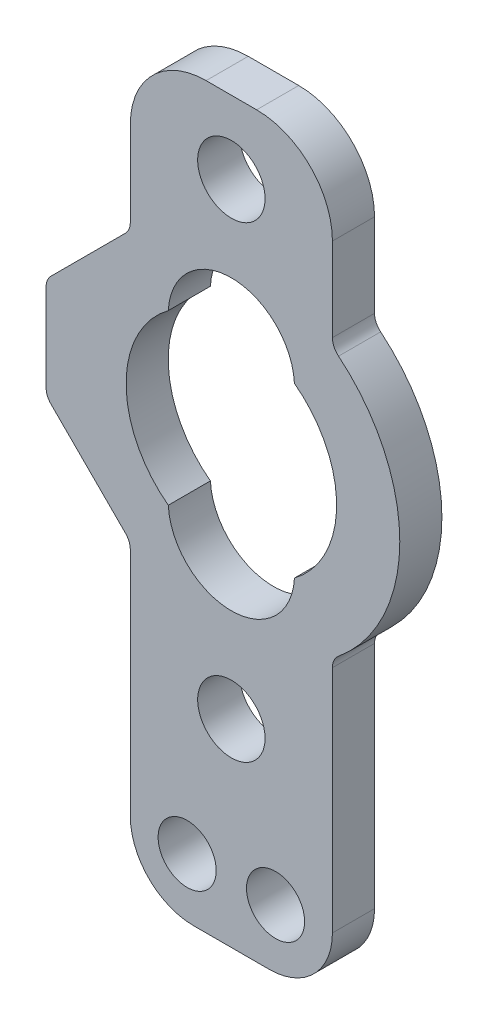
ISO-10303-21;
HEADER;
FILE_DESCRIPTION(('STEP AP214'),'2;1');
FILE_NAME('part.step','',(''),(''),'','','');
FILE_SCHEMA(('AUTOMOTIVE_DESIGN { 1 0 10303 214 1 1 1 1 }'));
ENDSEC;
DATA;
#1=APPLICATION_CONTEXT('core data for automotive mechanical design processes');
#2=APPLICATION_PROTOCOL_DEFINITION('international standard','automotive_design',2000,#1);
#3=PRODUCT_CONTEXT('',#1,'mechanical');
#4=PRODUCT('Part','Part','',(#3));
#5=PRODUCT_RELATED_PRODUCT_CATEGORY('part','',(#4));
#6=PRODUCT_DEFINITION_FORMATION('','',#4);
#7=PRODUCT_DEFINITION_CONTEXT('part definition',#1,'design');
#8=PRODUCT_DEFINITION('design','',#6,#7);
#9=PRODUCT_DEFINITION_SHAPE('','',#8);
#10=(LENGTH_UNIT() NAMED_UNIT(*) SI_UNIT(.MILLI.,.METRE.));
#11=(NAMED_UNIT(*) PLANE_ANGLE_UNIT() SI_UNIT($,.RADIAN.));
#12=(NAMED_UNIT(*) SI_UNIT($,.STERADIAN.) SOLID_ANGLE_UNIT());
#13=UNCERTAINTY_MEASURE_WITH_UNIT(LENGTH_MEASURE(1.E-05),#10,'distance_accuracy_value','');
#14=(GEOMETRIC_REPRESENTATION_CONTEXT(3) GLOBAL_UNCERTAINTY_ASSIGNED_CONTEXT((#13)) GLOBAL_UNIT_ASSIGNED_CONTEXT((#10,
#11,#12)) REPRESENTATION_CONTEXT('',''));
#15=CARTESIAN_POINT('',(0.,0.,0.));
#16=DIRECTION('',(0.,0.,1.));
#17=DIRECTION('',(1.,0.,0.));
#18=AXIS2_PLACEMENT_3D('',#15,#16,#17);
#19=CARTESIAN_POINT('',(4.50000000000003,7.5,5.));
#20=DIRECTION('',(0.,0.,-1.));
#21=DIRECTION('',(-1.,0.,0.));
#22=AXIS2_PLACEMENT_3D('',#19,#20,#21);
#23=PLANE('',#22);
#24=CARTESIAN_POINT('',(0.,61.375,5.));
#25=DIRECTION('',(0.,0.,1.));
#26=DIRECTION('',(-1.,0.,0.));
#27=AXIS2_PLACEMENT_3D('',#24,#25,#26);
#28=CIRCLE('',#27,7.5);
#29=CARTESIAN_POINT('',(7.49024984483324,61.7573051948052,5.));
#30=VERTEX_POINT('',#29);
#31=CARTESIAN_POINT('',(-7.49024984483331,61.7573051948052,5.));
#32=VERTEX_POINT('',#31);
#33=EDGE_CURVE('E205',#30,#32,#28,.T.);
#34=ORIENTED_EDGE('',*,*,#33,.F.);
#35=CARTESIAN_POINT('',(0.,51.75,5.));
#36=DIRECTION('',(0.,0.,1.));
#37=DIRECTION('',(1.,0.,0.));
#38=AXIS2_PLACEMENT_3D('',#35,#36,#37);
#39=CIRCLE('',#38,12.5);
#40=CARTESIAN_POINT('',(7.49024984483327,41.7426948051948,5.));
#41=VERTEX_POINT('',#40);
#42=EDGE_CURVE('E226',#41,#30,#39,.T.);
#43=ORIENTED_EDGE('',*,*,#42,.F.);
#44=CARTESIAN_POINT('',(0.,42.125,5.));
#45=DIRECTION('',(0.,0.,1.));
#46=DIRECTION('',(1.,0.,0.));
#47=AXIS2_PLACEMENT_3D('',#44,#45,#46);
#48=CIRCLE('',#47,7.5);
#49=CARTESIAN_POINT('',(-7.49024984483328,41.7426948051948,5.));
#50=VERTEX_POINT('',#49);
#51=EDGE_CURVE('E224',#50,#41,#48,.T.);
#52=ORIENTED_EDGE('',*,*,#51,.F.);
#53=CARTESIAN_POINT('',(0.,51.75,5.));
#54=DIRECTION('',(0.,0.,1.));
#55=DIRECTION('',(1.,0.,0.));
#56=AXIS2_PLACEMENT_3D('',#53,#54,#55);
#57=CIRCLE('',#56,12.5);
#58=EDGE_CURVE('E222',#32,#50,#57,.T.);
#59=ORIENTED_EDGE('',*,*,#58,.F.);
#60=EDGE_LOOP('',(#34,#43,#52,#59));
#61=FACE_BOUND('',#60,.T.);
#62=CARTESIAN_POINT('',(5.24999999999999,7.,5.));
#63=DIRECTION('',(0.,0.,1.));
#64=DIRECTION('',(-1.,0.,0.));
#65=AXIS2_PLACEMENT_3D('',#62,#63,#64);
#66=CIRCLE('',#65,3.45);
#67=CARTESIAN_POINT('',(1.79999999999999,7.,5.));
#68=VERTEX_POINT('',#67);
#69=EDGE_CURVE('E240',#68,#68,#66,.T.);
#70=ORIENTED_EDGE('',*,*,#69,.F.);
#71=EDGE_LOOP('',(#70));
#72=FACE_BOUND('',#71,.T.);
#73=CARTESIAN_POINT('',(4.50000000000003,7.5,5.));
#74=DIRECTION('',(0.,0.,1.));
#75=DIRECTION('',(-1.,0.,0.));
#76=AXIS2_PLACEMENT_3D('',#73,#74,#75);
#77=CIRCLE('',#76,7.5);
#78=CARTESIAN_POINT('',(4.49999999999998,0.,5.));
#79=VERTEX_POINT('',#78);
#80=CARTESIAN_POINT('',(12.,7.50000000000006,5.));
#81=VERTEX_POINT('',#80);
#82=EDGE_CURVE('E290',#79,#81,#77,.T.);
#83=ORIENTED_EDGE('',*,*,#82,.T.);
#84=DIRECTION('',(0.,1.,0.));
#85=VECTOR('',#84,1.);
#86=CARTESIAN_POINT('',(12.,7.50000000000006,5.));
#87=LINE('',#86,#85);
#88=CARTESIAN_POINT('',(12.,34.7794372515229,5.));
#89=VERTEX_POINT('',#88);
#90=EDGE_CURVE('E293',#81,#89,#87,.T.);
#91=ORIENTED_EDGE('',*,*,#90,.T.);
#92=CARTESIAN_POINT('',(14.,34.7794372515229,5.));
#93=DIRECTION('',(0.,0.,-1.));
#94=DIRECTION('',(1.,0.,0.));
#95=AXIS2_PLACEMENT_3D('',#92,#93,#94);
#96=CIRCLE('',#95,2.);
#97=CARTESIAN_POINT('',(12.7272727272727,36.3222156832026,5.));
#98=VERTEX_POINT('',#97);
#99=EDGE_CURVE('E295',#89,#98,#96,.T.);
#100=ORIENTED_EDGE('',*,*,#99,.T.);
#101=CARTESIAN_POINT('',(0.,51.75,5.));
#102=DIRECTION('',(0.,0.,1.));
#103=DIRECTION('',(-1.,0.,0.));
#104=AXIS2_PLACEMENT_3D('',#101,#102,#103);
#105=CIRCLE('',#104,20.);
#106=CARTESIAN_POINT('',(12.7272727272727,67.1777843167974,5.));
#107=VERTEX_POINT('',#106);
#108=EDGE_CURVE('E297',#98,#107,#105,.T.);
#109=ORIENTED_EDGE('',*,*,#108,.T.);
#110=CARTESIAN_POINT('',(14.,68.7205627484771,5.));
#111=DIRECTION('',(0.,0.,-1.));
#112=DIRECTION('',(-1.,0.,0.));
#113=AXIS2_PLACEMENT_3D('',#110,#111,#112);
#114=CIRCLE('',#113,2.);
#115=CARTESIAN_POINT('',(12.,68.7205627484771,5.));
#116=VERTEX_POINT('',#115);
#117=EDGE_CURVE('E299',#107,#116,#114,.T.);
#118=ORIENTED_EDGE('',*,*,#117,.T.);
#119=DIRECTION('',(0.,1.,0.));
#120=VECTOR('',#119,1.);
#121=CARTESIAN_POINT('',(12.,68.7205627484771,5.));
#122=LINE('',#121,#120);
#123=CARTESIAN_POINT('',(12.,78.6499999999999,5.));
#124=VERTEX_POINT('',#123);
#125=EDGE_CURVE('E301',#116,#124,#122,.T.);
#126=ORIENTED_EDGE('',*,*,#125,.T.);
#127=CARTESIAN_POINT('',(3.00000000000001,78.65,5.));
#128=DIRECTION('',(0.,0.,1.));
#129=DIRECTION('',(-1.,0.,0.));
#130=AXIS2_PLACEMENT_3D('',#127,#128,#129);
#131=CIRCLE('',#130,9.);
#132=CARTESIAN_POINT('',(2.99999999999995,87.65,5.));
#133=VERTEX_POINT('',#132);
#134=EDGE_CURVE('E303',#124,#133,#131,.T.);
#135=ORIENTED_EDGE('',*,*,#134,.T.);
#136=DIRECTION('',(-1.,0.,0.));
#137=VECTOR('',#136,1.);
#138=CARTESIAN_POINT('',(2.99999999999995,87.65,5.));
#139=LINE('',#138,#137);
#140=CARTESIAN_POINT('',(-2.99999999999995,87.65,5.));
#141=VERTEX_POINT('',#140);
#142=EDGE_CURVE('E305',#133,#141,#139,.T.);
#143=ORIENTED_EDGE('',*,*,#142,.T.);
#144=CARTESIAN_POINT('',(-3.00000000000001,78.65,5.));
#145=DIRECTION('',(0.,0.,1.));
#146=DIRECTION('',(1.,0.,0.));
#147=AXIS2_PLACEMENT_3D('',#144,#145,#146);
#148=CIRCLE('',#147,9.);
#149=CARTESIAN_POINT('',(-12.,78.6499999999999,5.));
#150=VERTEX_POINT('',#149);
#151=EDGE_CURVE('E307',#141,#150,#148,.T.);
#152=ORIENTED_EDGE('',*,*,#151,.T.);
#153=DIRECTION('',(0.,-1.,0.));
#154=VECTOR('',#153,1.);
#155=CARTESIAN_POINT('',(-12.,68.5784271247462,5.));
#156=LINE('',#155,#154);
#157=CARTESIAN_POINT('',(-12.,68.5784271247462,5.));
#158=VERTEX_POINT('',#157);
#159=EDGE_CURVE('E309',#150,#158,#156,.T.);
#160=ORIENTED_EDGE('',*,*,#159,.T.);
#161=CARTESIAN_POINT('',(-14.,68.5784271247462,5.));
#162=DIRECTION('',(0.,0.,-1.));
#163=DIRECTION('',(1.,0.,0.));
#164=AXIS2_PLACEMENT_3D('',#161,#162,#163);
#165=CIRCLE('',#164,2.);
#166=CARTESIAN_POINT('',(-12.5857864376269,67.1642135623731,5.));
#167=VERTEX_POINT('',#166);
#168=EDGE_CURVE('E311',#158,#167,#165,.T.);
#169=ORIENTED_EDGE('',*,*,#168,.T.);
#170=DIRECTION('',(-0.707106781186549,-0.707106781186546,0.));
#171=VECTOR('',#170,1.);
#172=CARTESIAN_POINT('',(-12.5857864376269,67.1642135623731,5.));
#173=LINE('',#172,#171);
#174=CARTESIAN_POINT('',(-21.4142135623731,58.335786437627,5.));
#175=VERTEX_POINT('',#174);
#176=EDGE_CURVE('E313',#167,#175,#173,.T.);
#177=ORIENTED_EDGE('',*,*,#176,.T.);
#178=CARTESIAN_POINT('',(-20.,56.9215728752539,5.));
#179=DIRECTION('',(0.,0.,1.));
#180=DIRECTION('',(-1.,0.,0.));
#181=AXIS2_PLACEMENT_3D('',#178,#179,#180);
#182=CIRCLE('',#181,2.);
#183=CARTESIAN_POINT('',(-22.,56.9215728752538,5.));
#184=VERTEX_POINT('',#183);
#185=EDGE_CURVE('E315',#175,#184,#182,.T.);
#186=ORIENTED_EDGE('',*,*,#185,.T.);
#187=DIRECTION('',(0.,-1.,0.));
#188=VECTOR('',#187,1.);
#189=CARTESIAN_POINT('',(-22.,56.9215728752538,5.));
#190=LINE('',#189,#188);
#191=CARTESIAN_POINT('',(-22.,46.5784271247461,5.));
#192=VERTEX_POINT('',#191);
#193=EDGE_CURVE('E317',#184,#192,#190,.T.);
#194=ORIENTED_EDGE('',*,*,#193,.T.);
#195=CARTESIAN_POINT('',(-20.,46.5784271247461,5.));
#196=DIRECTION('',(0.,0.,1.));
#197=DIRECTION('',(1.,0.,0.));
#198=AXIS2_PLACEMENT_3D('',#195,#196,#197);
#199=CIRCLE('',#198,2.);
#200=CARTESIAN_POINT('',(-21.4142135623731,45.164213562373,5.));
#201=VERTEX_POINT('',#200);
#202=EDGE_CURVE('E319',#192,#201,#199,.T.);
#203=ORIENTED_EDGE('',*,*,#202,.T.);
#204=DIRECTION('',(0.707106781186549,-0.707106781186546,0.));
#205=VECTOR('',#204,1.);
#206=CARTESIAN_POINT('',(-12.5857864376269,36.3357864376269,5.));
#207=LINE('',#206,#205);
#208=CARTESIAN_POINT('',(-12.5857864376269,36.3357864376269,5.));
#209=VERTEX_POINT('',#208);
#210=EDGE_CURVE('E321',#201,#209,#207,.T.);
#211=ORIENTED_EDGE('',*,*,#210,.T.);
#212=CARTESIAN_POINT('',(-14.,34.9215728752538,5.));
#213=DIRECTION('',(0.,0.,-1.));
#214=DIRECTION('',(-1.,0.,0.));
#215=AXIS2_PLACEMENT_3D('',#212,#213,#214);
#216=CIRCLE('',#215,2.);
#217=CARTESIAN_POINT('',(-12.,34.9215728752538,5.));
#218=VERTEX_POINT('',#217);
#219=EDGE_CURVE('E323',#209,#218,#216,.T.);
#220=ORIENTED_EDGE('',*,*,#219,.T.);
#221=DIRECTION('',(0.,-1.,0.));
#222=VECTOR('',#221,1.);
#223=CARTESIAN_POINT('',(-12.,7.50000000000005,5.));
#224=LINE('',#223,#222);
#225=CARTESIAN_POINT('',(-12.,7.50000000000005,5.));
#226=VERTEX_POINT('',#225);
#227=EDGE_CURVE('E325',#218,#226,#224,.T.);
#228=ORIENTED_EDGE('',*,*,#227,.T.);
#229=CARTESIAN_POINT('',(-4.50000000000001,7.5,5.));
#230=DIRECTION('',(0.,0.,1.));
#231=DIRECTION('',(-1.,0.,0.));
#232=AXIS2_PLACEMENT_3D('',#229,#230,#231);
#233=CIRCLE('',#232,7.5);
#234=CARTESIAN_POINT('',(-4.49999999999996,0.,5.));
#235=VERTEX_POINT('',#234);
#236=EDGE_CURVE('E327',#226,#235,#233,.T.);
#237=ORIENTED_EDGE('',*,*,#236,.T.);
#238=DIRECTION('',(1.,0.,0.));
#239=VECTOR('',#238,1.);
#240=CARTESIAN_POINT('',(-4.49999999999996,0.,5.));
#241=LINE('',#240,#239);
#242=EDGE_CURVE('E329',#235,#79,#241,.T.);
#243=ORIENTED_EDGE('',*,*,#242,.T.);
#244=EDGE_LOOP('',(#83,#91,#100,#109,#118,#126,#135,#143,#152,#160,#169,#177,#186,#194,#203,
#211,#220,#228,#237,#243));
#245=FACE_BOUND('',#244,.T.);
#246=CARTESIAN_POINT('',(-5.24999999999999,7.,5.));
#247=DIRECTION('',(0.,0.,1.));
#248=DIRECTION('',(1.,0.,0.));
#249=AXIS2_PLACEMENT_3D('',#246,#247,#248);
#250=CIRCLE('',#249,3.45);
#251=CARTESIAN_POINT('',(-1.79999999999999,7.,5.));
#252=VERTEX_POINT('',#251);
#253=EDGE_CURVE('E246',#252,#252,#250,.T.);
#254=ORIENTED_EDGE('',*,*,#253,.F.);
#255=EDGE_LOOP('',(#254));
#256=FACE_BOUND('',#255,.T.);
#257=CARTESIAN_POINT('',(0.,23.5,5.));
#258=DIRECTION('',(0.,0.,1.));
#259=DIRECTION('',(1.,0.,0.));
#260=AXIS2_PLACEMENT_3D('',#257,#258,#259);
#261=CIRCLE('',#260,4.);
#262=CARTESIAN_POINT('',(4.,23.5,5.));
#263=VERTEX_POINT('',#262);
#264=EDGE_CURVE('E234',#263,#263,#261,.T.);
#265=ORIENTED_EDGE('',*,*,#264,.F.);
#266=EDGE_LOOP('',(#265));
#267=FACE_BOUND('',#266,.T.);
#268=CARTESIAN_POINT('',(0.,79.,5.));
#269=DIRECTION('',(0.,0.,1.));
#270=DIRECTION('',(1.,0.,0.));
#271=AXIS2_PLACEMENT_3D('',#268,#269,#270);
#272=CIRCLE('',#271,4.);
#273=CARTESIAN_POINT('',(4.,79.,5.));
#274=VERTEX_POINT('',#273);
#275=EDGE_CURVE('E212',#274,#274,#272,.T.);
#276=ORIENTED_EDGE('',*,*,#275,.F.);
#277=EDGE_LOOP('',(#276));
#278=FACE_BOUND('',#277,.T.);
#279=ADVANCED_FACE('F29',(#61,#72,#245,#256,#267,#278),#23,.F.);
#280=CARTESIAN_POINT('',(4.50000000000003,7.5,0.));
#281=DIRECTION('',(0.,0.,-1.));
#282=DIRECTION('',(-1.,0.,0.));
#283=AXIS2_PLACEMENT_3D('',#280,#281,#282);
#284=PLANE('',#283);
#285=CARTESIAN_POINT('',(0.,51.75,0.));
#286=DIRECTION('',(0.,0.,1.));
#287=DIRECTION('',(1.,0.,0.));
#288=AXIS2_PLACEMENT_3D('',#285,#286,#287);
#289=CIRCLE('',#288,12.5);
#290=CARTESIAN_POINT('',(7.49024984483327,41.7426948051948,0.));
#291=VERTEX_POINT('',#290);
#292=CARTESIAN_POINT('',(7.49024984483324,61.7573051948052,0.));
#293=VERTEX_POINT('',#292);
#294=EDGE_CURVE('E211',#291,#293,#289,.T.);
#295=ORIENTED_EDGE('',*,*,#294,.T.);
#296=CARTESIAN_POINT('',(0.,61.375,0.));
#297=DIRECTION('',(0.,0.,1.));
#298=DIRECTION('',(-1.,0.,0.));
#299=AXIS2_PLACEMENT_3D('',#296,#297,#298);
#300=CIRCLE('',#299,7.5);
#301=CARTESIAN_POINT('',(-7.49024984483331,61.7573051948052,0.));
#302=VERTEX_POINT('',#301);
#303=EDGE_CURVE('E52',#293,#302,#300,.T.);
#304=ORIENTED_EDGE('',*,*,#303,.T.);
#305=CARTESIAN_POINT('',(0.,51.75,0.));
#306=DIRECTION('',(0.,0.,1.));
#307=DIRECTION('',(1.,0.,0.));
#308=AXIS2_PLACEMENT_3D('',#305,#306,#307);
#309=CIRCLE('',#308,12.5);
#310=CARTESIAN_POINT('',(-7.49024984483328,41.7426948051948,0.));
#311=VERTEX_POINT('',#310);
#312=EDGE_CURVE('E192',#302,#311,#309,.T.);
#313=ORIENTED_EDGE('',*,*,#312,.T.);
#314=CARTESIAN_POINT('',(0.,42.125,0.));
#315=DIRECTION('',(0.,0.,1.));
#316=DIRECTION('',(1.,0.,0.));
#317=AXIS2_PLACEMENT_3D('',#314,#315,#316);
#318=CIRCLE('',#317,7.5);
#319=EDGE_CURVE('E201',#311,#291,#318,.T.);
#320=ORIENTED_EDGE('',*,*,#319,.T.);
#321=EDGE_LOOP('',(#295,#304,#313,#320));
#322=FACE_BOUND('',#321,.T.);
#323=CARTESIAN_POINT('',(5.24999999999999,7.,0.));
#324=DIRECTION('',(0.,0.,1.));
#325=DIRECTION('',(-1.,0.,0.));
#326=AXIS2_PLACEMENT_3D('',#323,#324,#325);
#327=CIRCLE('',#326,3.45);
#328=CARTESIAN_POINT('',(1.79999999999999,7.,0.));
#329=VERTEX_POINT('',#328);
#330=EDGE_CURVE('E237',#329,#329,#327,.T.);
#331=ORIENTED_EDGE('',*,*,#330,.T.);
#332=EDGE_LOOP('',(#331));
#333=FACE_BOUND('',#332,.T.);
#334=CARTESIAN_POINT('',(4.50000000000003,7.5,0.));
#335=DIRECTION('',(0.,0.,1.));
#336=DIRECTION('',(-1.,0.,0.));
#337=AXIS2_PLACEMENT_3D('',#334,#335,#336);
#338=CIRCLE('',#337,7.5);
#339=CARTESIAN_POINT('',(4.49999999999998,0.,0.));
#340=VERTEX_POINT('',#339);
#341=CARTESIAN_POINT('',(12.,7.50000000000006,0.));
#342=VERTEX_POINT('',#341);
#343=EDGE_CURVE('E249',#340,#342,#338,.T.);
#344=ORIENTED_EDGE('',*,*,#343,.F.);
#345=DIRECTION('',(1.,0.,0.));
#346=VECTOR('',#345,1.);
#347=CARTESIAN_POINT('',(-4.49999999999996,0.,0.));
#348=LINE('',#347,#346);
#349=CARTESIAN_POINT('',(-4.49999999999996,0.,0.));
#350=VERTEX_POINT('',#349);
#351=EDGE_CURVE('E288',#350,#340,#348,.T.);
#352=ORIENTED_EDGE('',*,*,#351,.F.);
#353=CARTESIAN_POINT('',(-4.50000000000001,7.5,0.));
#354=DIRECTION('',(0.,0.,1.));
#355=DIRECTION('',(-1.,0.,0.));
#356=AXIS2_PLACEMENT_3D('',#353,#354,#355);
#357=CIRCLE('',#356,7.5);
#358=CARTESIAN_POINT('',(-12.,7.50000000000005,0.));
#359=VERTEX_POINT('',#358);
#360=EDGE_CURVE('E286',#359,#350,#357,.T.);
#361=ORIENTED_EDGE('',*,*,#360,.F.);
#362=DIRECTION('',(0.,-1.,0.));
#363=VECTOR('',#362,1.);
#364=CARTESIAN_POINT('',(-12.,7.50000000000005,0.));
#365=LINE('',#364,#363);
#366=CARTESIAN_POINT('',(-12.,34.9215728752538,0.));
#367=VERTEX_POINT('',#366);
#368=EDGE_CURVE('E284',#367,#359,#365,.T.);
#369=ORIENTED_EDGE('',*,*,#368,.F.);
#370=CARTESIAN_POINT('',(-14.,34.9215728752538,0.));
#371=DIRECTION('',(0.,0.,-1.));
#372=DIRECTION('',(-1.,0.,0.));
#373=AXIS2_PLACEMENT_3D('',#370,#371,#372);
#374=CIRCLE('',#373,2.);
#375=CARTESIAN_POINT('',(-12.5857864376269,36.3357864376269,0.));
#376=VERTEX_POINT('',#375);
#377=EDGE_CURVE('E282',#376,#367,#374,.T.);
#378=ORIENTED_EDGE('',*,*,#377,.F.);
#379=DIRECTION('',(0.707106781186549,-0.707106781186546,0.));
#380=VECTOR('',#379,1.);
#381=CARTESIAN_POINT('',(-12.5857864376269,36.3357864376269,0.));
#382=LINE('',#381,#380);
#383=CARTESIAN_POINT('',(-21.4142135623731,45.164213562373,0.));
#384=VERTEX_POINT('',#383);
#385=EDGE_CURVE('E280',#384,#376,#382,.T.);
#386=ORIENTED_EDGE('',*,*,#385,.F.);
#387=CARTESIAN_POINT('',(-20.,46.5784271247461,0.));
#388=DIRECTION('',(0.,0.,1.));
#389=DIRECTION('',(1.,0.,0.));
#390=AXIS2_PLACEMENT_3D('',#387,#388,#389);
#391=CIRCLE('',#390,2.);
#392=CARTESIAN_POINT('',(-22.,46.5784271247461,0.));
#393=VERTEX_POINT('',#392);
#394=EDGE_CURVE('E278',#393,#384,#391,.T.);
#395=ORIENTED_EDGE('',*,*,#394,.F.);
#396=DIRECTION('',(0.,-1.,0.));
#397=VECTOR('',#396,1.);
#398=CARTESIAN_POINT('',(-22.,56.9215728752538,0.));
#399=LINE('',#398,#397);
#400=CARTESIAN_POINT('',(-22.,56.9215728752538,0.));
#401=VERTEX_POINT('',#400);
#402=EDGE_CURVE('E276',#401,#393,#399,.T.);
#403=ORIENTED_EDGE('',*,*,#402,.F.);
#404=CARTESIAN_POINT('',(-20.,56.9215728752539,0.));
#405=DIRECTION('',(0.,0.,1.));
#406=DIRECTION('',(-1.,0.,0.));
#407=AXIS2_PLACEMENT_3D('',#404,#405,#406);
#408=CIRCLE('',#407,2.);
#409=CARTESIAN_POINT('',(-21.4142135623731,58.335786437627,0.));
#410=VERTEX_POINT('',#409);
#411=EDGE_CURVE('E274',#410,#401,#408,.T.);
#412=ORIENTED_EDGE('',*,*,#411,.F.);
#413=DIRECTION('',(-0.707106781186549,-0.707106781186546,0.));
#414=VECTOR('',#413,1.);
#415=CARTESIAN_POINT('',(-12.5857864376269,67.1642135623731,0.));
#416=LINE('',#415,#414);
#417=CARTESIAN_POINT('',(-12.5857864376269,67.1642135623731,0.));
#418=VERTEX_POINT('',#417);
#419=EDGE_CURVE('E272',#418,#410,#416,.T.);
#420=ORIENTED_EDGE('',*,*,#419,.F.);
#421=CARTESIAN_POINT('',(-14.,68.5784271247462,0.));
#422=DIRECTION('',(0.,0.,-1.));
#423=DIRECTION('',(1.,0.,0.));
#424=AXIS2_PLACEMENT_3D('',#421,#422,#423);
#425=CIRCLE('',#424,2.);
#426=CARTESIAN_POINT('',(-12.,68.5784271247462,0.));
#427=VERTEX_POINT('',#426);
#428=EDGE_CURVE('E270',#427,#418,#425,.T.);
#429=ORIENTED_EDGE('',*,*,#428,.F.);
#430=DIRECTION('',(0.,-1.,0.));
#431=VECTOR('',#430,1.);
#432=CARTESIAN_POINT('',(-12.,68.5784271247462,0.));
#433=LINE('',#432,#431);
#434=CARTESIAN_POINT('',(-12.,78.6499999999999,0.));
#435=VERTEX_POINT('',#434);
#436=EDGE_CURVE('E268',#435,#427,#433,.T.);
#437=ORIENTED_EDGE('',*,*,#436,.F.);
#438=CARTESIAN_POINT('',(-3.00000000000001,78.65,0.));
#439=DIRECTION('',(0.,0.,1.));
#440=DIRECTION('',(1.,0.,0.));
#441=AXIS2_PLACEMENT_3D('',#438,#439,#440);
#442=CIRCLE('',#441,9.);
#443=CARTESIAN_POINT('',(-2.99999999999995,87.65,0.));
#444=VERTEX_POINT('',#443);
#445=EDGE_CURVE('E266',#444,#435,#442,.T.);
#446=ORIENTED_EDGE('',*,*,#445,.F.);
#447=DIRECTION('',(-1.,0.,0.));
#448=VECTOR('',#447,1.);
#449=CARTESIAN_POINT('',(2.99999999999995,87.65,0.));
#450=LINE('',#449,#448);
#451=CARTESIAN_POINT('',(2.99999999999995,87.65,0.));
#452=VERTEX_POINT('',#451);
#453=EDGE_CURVE('E264',#452,#444,#450,.T.);
#454=ORIENTED_EDGE('',*,*,#453,.F.);
#455=CARTESIAN_POINT('',(3.00000000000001,78.65,0.));
#456=DIRECTION('',(0.,0.,1.));
#457=DIRECTION('',(-1.,0.,0.));
#458=AXIS2_PLACEMENT_3D('',#455,#456,#457);
#459=CIRCLE('',#458,9.);
#460=CARTESIAN_POINT('',(12.,78.6499999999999,0.));
#461=VERTEX_POINT('',#460);
#462=EDGE_CURVE('E262',#461,#452,#459,.T.);
#463=ORIENTED_EDGE('',*,*,#462,.F.);
#464=DIRECTION('',(0.,1.,0.));
#465=VECTOR('',#464,1.);
#466=CARTESIAN_POINT('',(12.,68.7205627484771,0.));
#467=LINE('',#466,#465);
#468=CARTESIAN_POINT('',(12.,68.7205627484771,0.));
#469=VERTEX_POINT('',#468);
#470=EDGE_CURVE('E260',#469,#461,#467,.T.);
#471=ORIENTED_EDGE('',*,*,#470,.F.);
#472=CARTESIAN_POINT('',(14.,68.7205627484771,0.));
#473=DIRECTION('',(0.,0.,-1.));
#474=DIRECTION('',(-1.,0.,0.));
#475=AXIS2_PLACEMENT_3D('',#472,#473,#474);
#476=CIRCLE('',#475,2.);
#477=CARTESIAN_POINT('',(12.7272727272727,67.1777843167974,0.));
#478=VERTEX_POINT('',#477);
#479=EDGE_CURVE('E258',#478,#469,#476,.T.);
#480=ORIENTED_EDGE('',*,*,#479,.F.);
#481=CARTESIAN_POINT('',(0.,51.75,0.));
#482=DIRECTION('',(0.,0.,1.));
#483=DIRECTION('',(-1.,0.,0.));
#484=AXIS2_PLACEMENT_3D('',#481,#482,#483);
#485=CIRCLE('',#484,20.);
#486=CARTESIAN_POINT('',(12.7272727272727,36.3222156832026,0.));
#487=VERTEX_POINT('',#486);
#488=EDGE_CURVE('E256',#487,#478,#485,.T.);
#489=ORIENTED_EDGE('',*,*,#488,.F.);
#490=CARTESIAN_POINT('',(14.,34.7794372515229,0.));
#491=DIRECTION('',(0.,0.,-1.));
#492=DIRECTION('',(1.,0.,0.));
#493=AXIS2_PLACEMENT_3D('',#490,#491,#492);
#494=CIRCLE('',#493,2.);
#495=CARTESIAN_POINT('',(12.,34.7794372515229,0.));
#496=VERTEX_POINT('',#495);
#497=EDGE_CURVE('E254',#496,#487,#494,.T.);
#498=ORIENTED_EDGE('',*,*,#497,.F.);
#499=DIRECTION('',(0.,1.,0.));
#500=VECTOR('',#499,1.);
#501=CARTESIAN_POINT('',(12.,7.50000000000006,0.));
#502=LINE('',#501,#500);
#503=EDGE_CURVE('E252',#342,#496,#502,.T.);
#504=ORIENTED_EDGE('',*,*,#503,.F.);
#505=EDGE_LOOP('',(#344,#352,#361,#369,#378,#386,#395,#403,#412,#420,#429,#437,#446,#454,#463,
#471,#480,#489,#498,#504));
#506=FACE_BOUND('',#505,.T.);
#507=CARTESIAN_POINT('',(-5.24999999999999,7.,0.));
#508=DIRECTION('',(0.,0.,1.));
#509=DIRECTION('',(1.,0.,0.));
#510=AXIS2_PLACEMENT_3D('',#507,#508,#509);
#511=CIRCLE('',#510,3.45);
#512=CARTESIAN_POINT('',(-1.79999999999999,7.,0.));
#513=VERTEX_POINT('',#512);
#514=EDGE_CURVE('E243',#513,#513,#511,.T.);
#515=ORIENTED_EDGE('',*,*,#514,.T.);
#516=EDGE_LOOP('',(#515));
#517=FACE_BOUND('',#516,.T.);
#518=CARTESIAN_POINT('',(0.,23.5,0.));
#519=DIRECTION('',(0.,0.,1.));
#520=DIRECTION('',(1.,0.,0.));
#521=AXIS2_PLACEMENT_3D('',#518,#519,#520);
#522=CIRCLE('',#521,4.);
#523=CARTESIAN_POINT('',(4.,23.5,0.));
#524=VERTEX_POINT('',#523);
#525=EDGE_CURVE('E206',#524,#524,#522,.T.);
#526=ORIENTED_EDGE('',*,*,#525,.T.);
#527=EDGE_LOOP('',(#526));
#528=FACE_BOUND('',#527,.T.);
#529=CARTESIAN_POINT('',(0.,79.,0.));
#530=DIRECTION('',(0.,0.,1.));
#531=DIRECTION('',(1.,0.,0.));
#532=AXIS2_PLACEMENT_3D('',#529,#530,#531);
#533=CIRCLE('',#532,4.);
#534=CARTESIAN_POINT('',(4.,79.,0.));
#535=VERTEX_POINT('',#534);
#536=EDGE_CURVE('E215',#535,#535,#533,.T.);
#537=ORIENTED_EDGE('',*,*,#536,.T.);
#538=EDGE_LOOP('',(#537));
#539=FACE_BOUND('',#538,.T.);
#540=ADVANCED_FACE('F209',(#322,#333,#506,#517,#528,#539),#284,.T.);
#541=CARTESIAN_POINT('',(4.50000000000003,7.5,5.));
#542=DIRECTION('',(0.,0.,-1.));
#543=DIRECTION('',(-1.,0.,0.));
#544=AXIS2_PLACEMENT_3D('',#541,#542,#543);
#545=CYLINDRICAL_SURFACE('',#544,7.5);
#546=ORIENTED_EDGE('',*,*,#343,.T.);
#547=DIRECTION('',(0.,0.,-1.));
#548=VECTOR('',#547,1.);
#549=CARTESIAN_POINT('',(12.,7.50000000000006,5.));
#550=LINE('',#549,#548);
#551=EDGE_CURVE('E11',#81,#342,#550,.T.);
#552=ORIENTED_EDGE('',*,*,#551,.F.);
#553=ORIENTED_EDGE('',*,*,#82,.F.);
#554=DIRECTION('',(0.,0.,-1.));
#555=VECTOR('',#554,1.);
#556=CARTESIAN_POINT('',(4.49999999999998,0.,5.));
#557=LINE('',#556,#555);
#558=EDGE_CURVE('E331',#79,#340,#557,.T.);
#559=ORIENTED_EDGE('',*,*,#558,.T.);
#560=EDGE_LOOP('',(#546,#552,#553,#559));
#561=FACE_BOUND('',#560,.T.);
#562=ADVANCED_FACE('F31',(#561),#545,.T.);
#563=CARTESIAN_POINT('',(12.,7.50000000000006,5.));
#564=DIRECTION('',(-1.,0.,0.));
#565=DIRECTION('',(0.,-1.,0.));
#566=AXIS2_PLACEMENT_3D('',#563,#564,#565);
#567=PLANE('',#566);
#568=ORIENTED_EDGE('',*,*,#503,.T.);
#569=DIRECTION('',(0.,0.,-1.));
#570=VECTOR('',#569,1.);
#571=CARTESIAN_POINT('',(12.,34.7794372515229,5.));
#572=LINE('',#571,#570);
#573=EDGE_CURVE('E37',#89,#496,#572,.T.);
#574=ORIENTED_EDGE('',*,*,#573,.F.);
#575=ORIENTED_EDGE('',*,*,#90,.F.);
#576=ORIENTED_EDGE('',*,*,#551,.T.);
#577=EDGE_LOOP('',(#568,#574,#575,#576));
#578=FACE_BOUND('',#577,.T.);
#579=ADVANCED_FACE('F412',(#578),#567,.F.);
#580=CARTESIAN_POINT('',(14.,34.7794372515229,5.));
#581=DIRECTION('',(0.,0.,-1.));
#582=DIRECTION('',(-1.,0.,0.));
#583=AXIS2_PLACEMENT_3D('',#580,#581,#582);
#584=CYLINDRICAL_SURFACE('',#583,2.);
#585=ORIENTED_EDGE('',*,*,#497,.T.);
#586=DIRECTION('',(0.,0.,-1.));
#587=VECTOR('',#586,1.);
#588=CARTESIAN_POINT('',(12.7272727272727,36.3222156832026,5.));
#589=LINE('',#588,#587);
#590=EDGE_CURVE('E382',#98,#487,#589,.T.);
#591=ORIENTED_EDGE('',*,*,#590,.F.);
#592=ORIENTED_EDGE('',*,*,#99,.F.);
#593=ORIENTED_EDGE('',*,*,#573,.T.);
#594=EDGE_LOOP('',(#585,#591,#592,#593));
#595=FACE_BOUND('',#594,.T.);
#596=ADVANCED_FACE('F389',(#595),#584,.F.);
#597=CARTESIAN_POINT('',(0.,51.75,5.));
#598=DIRECTION('',(0.,0.,-1.));
#599=DIRECTION('',(-1.,0.,0.));
#600=AXIS2_PLACEMENT_3D('',#597,#598,#599);
#601=CYLINDRICAL_SURFACE('',#600,20.);
#602=ORIENTED_EDGE('',*,*,#488,.T.);
#603=DIRECTION('',(0.,0.,-1.));
#604=VECTOR('',#603,1.);
#605=CARTESIAN_POINT('',(12.7272727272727,67.1777843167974,5.));
#606=LINE('',#605,#604);
#607=EDGE_CURVE('E379',#107,#478,#606,.T.);
#608=ORIENTED_EDGE('',*,*,#607,.F.);
#609=ORIENTED_EDGE('',*,*,#108,.F.);
#610=ORIENTED_EDGE('',*,*,#590,.T.);
#611=EDGE_LOOP('',(#602,#608,#609,#610));
#612=FACE_BOUND('',#611,.T.);
#613=ADVANCED_FACE('F400',(#612),#601,.T.);
#614=CARTESIAN_POINT('',(14.,68.7205627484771,5.));
#615=DIRECTION('',(0.,0.,-1.));
#616=DIRECTION('',(-1.,0.,0.));
#617=AXIS2_PLACEMENT_3D('',#614,#615,#616);
#618=CYLINDRICAL_SURFACE('',#617,2.);
#619=ORIENTED_EDGE('',*,*,#479,.T.);
#620=DIRECTION('',(0.,0.,-1.));
#621=VECTOR('',#620,1.);
#622=CARTESIAN_POINT('',(12.,68.7205627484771,5.));
#623=LINE('',#622,#621);
#624=EDGE_CURVE('E376',#116,#469,#623,.T.);
#625=ORIENTED_EDGE('',*,*,#624,.F.);
#626=ORIENTED_EDGE('',*,*,#117,.F.);
#627=ORIENTED_EDGE('',*,*,#607,.T.);
#628=EDGE_LOOP('',(#619,#625,#626,#627));
#629=FACE_BOUND('',#628,.T.);
#630=ADVANCED_FACE('F404',(#629),#618,.F.);
#631=CARTESIAN_POINT('',(12.,68.7205627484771,5.));
#632=DIRECTION('',(-1.,0.,0.));
#633=DIRECTION('',(0.,-1.,0.));
#634=AXIS2_PLACEMENT_3D('',#631,#632,#633);
#635=PLANE('',#634);
#636=ORIENTED_EDGE('',*,*,#470,.T.);
#637=DIRECTION('',(0.,0.,-1.));
#638=VECTOR('',#637,1.);
#639=CARTESIAN_POINT('',(12.,78.6499999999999,5.));
#640=LINE('',#639,#638);
#641=EDGE_CURVE('E373',#124,#461,#640,.T.);
#642=ORIENTED_EDGE('',*,*,#641,.F.);
#643=ORIENTED_EDGE('',*,*,#125,.F.);
#644=ORIENTED_EDGE('',*,*,#624,.T.);
#645=EDGE_LOOP('',(#636,#642,#643,#644));
#646=FACE_BOUND('',#645,.T.);
#647=ADVANCED_FACE('F485',(#646),#635,.F.);
#648=CARTESIAN_POINT('',(3.00000000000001,78.65,5.));
#649=DIRECTION('',(0.,0.,-1.));
#650=DIRECTION('',(-1.,0.,0.));
#651=AXIS2_PLACEMENT_3D('',#648,#649,#650);
#652=CYLINDRICAL_SURFACE('',#651,9.);
#653=ORIENTED_EDGE('',*,*,#462,.T.);
#654=DIRECTION('',(0.,0.,-1.));
#655=VECTOR('',#654,1.);
#656=CARTESIAN_POINT('',(2.99999999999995,87.65,5.));
#657=LINE('',#656,#655);
#658=EDGE_CURVE('E370',#133,#452,#657,.T.);
#659=ORIENTED_EDGE('',*,*,#658,.F.);
#660=ORIENTED_EDGE('',*,*,#134,.F.);
#661=ORIENTED_EDGE('',*,*,#641,.T.);
#662=EDGE_LOOP('',(#653,#659,#660,#661));
#663=FACE_BOUND('',#662,.T.);
#664=ADVANCED_FACE('F483',(#663),#652,.T.);
#665=CARTESIAN_POINT('',(2.99999999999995,87.65,5.));
#666=DIRECTION('',(0.,-1.,0.));
#667=DIRECTION('',(0.,0.,-1.));
#668=AXIS2_PLACEMENT_3D('',#665,#666,#667);
#669=PLANE('',#668);
#670=ORIENTED_EDGE('',*,*,#453,.T.);
#671=DIRECTION('',(0.,0.,-1.));
#672=VECTOR('',#671,1.);
#673=CARTESIAN_POINT('',(-2.99999999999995,87.65,5.));
#674=LINE('',#673,#672);
#675=EDGE_CURVE('E367',#141,#444,#674,.T.);
#676=ORIENTED_EDGE('',*,*,#675,.F.);
#677=ORIENTED_EDGE('',*,*,#142,.F.);
#678=ORIENTED_EDGE('',*,*,#658,.T.);
#679=EDGE_LOOP('',(#670,#676,#677,#678));
#680=FACE_BOUND('',#679,.T.);
#681=ADVANCED_FACE('F478',(#680),#669,.F.);
#682=CARTESIAN_POINT('',(-3.00000000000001,78.65,5.));
#683=DIRECTION('',(0.,0.,-1.));
#684=DIRECTION('',(-1.,0.,0.));
#685=AXIS2_PLACEMENT_3D('',#682,#683,#684);
#686=CYLINDRICAL_SURFACE('',#685,9.);
#687=ORIENTED_EDGE('',*,*,#445,.T.);
#688=DIRECTION('',(0.,0.,-1.));
#689=VECTOR('',#688,1.);
#690=CARTESIAN_POINT('',(-12.,78.6499999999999,5.));
#691=LINE('',#690,#689);
#692=EDGE_CURVE('E364',#150,#435,#691,.T.);
#693=ORIENTED_EDGE('',*,*,#692,.F.);
#694=ORIENTED_EDGE('',*,*,#151,.F.);
#695=ORIENTED_EDGE('',*,*,#675,.T.);
#696=EDGE_LOOP('',(#687,#693,#694,#695));
#697=FACE_BOUND('',#696,.T.);
#698=ADVANCED_FACE('F473',(#697),#686,.T.);
#699=CARTESIAN_POINT('',(-12.,68.5784271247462,5.));
#700=DIRECTION('',(1.,0.,0.));
#701=DIRECTION('',(0.,1.,0.));
#702=AXIS2_PLACEMENT_3D('',#699,#700,#701);
#703=PLANE('',#702);
#704=ORIENTED_EDGE('',*,*,#436,.T.);
#705=DIRECTION('',(0.,0.,-1.));
#706=VECTOR('',#705,1.);
#707=CARTESIAN_POINT('',(-12.,68.5784271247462,5.));
#708=LINE('',#707,#706);
#709=EDGE_CURVE('E361',#158,#427,#708,.T.);
#710=ORIENTED_EDGE('',*,*,#709,.F.);
#711=ORIENTED_EDGE('',*,*,#159,.F.);
#712=ORIENTED_EDGE('',*,*,#692,.T.);
#713=EDGE_LOOP('',(#704,#710,#711,#712));
#714=FACE_BOUND('',#713,.T.);
#715=ADVANCED_FACE('F469',(#714),#703,.F.);
#716=CARTESIAN_POINT('',(-14.,68.5784271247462,5.));
#717=DIRECTION('',(0.,0.,-1.));
#718=DIRECTION('',(-1.,0.,0.));
#719=AXIS2_PLACEMENT_3D('',#716,#717,#718);
#720=CYLINDRICAL_SURFACE('',#719,2.);
#721=ORIENTED_EDGE('',*,*,#428,.T.);
#722=DIRECTION('',(0.,0.,-1.));
#723=VECTOR('',#722,1.);
#724=CARTESIAN_POINT('',(-12.5857864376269,67.1642135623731,5.));
#725=LINE('',#724,#723);
#726=EDGE_CURVE('E358',#167,#418,#725,.T.);
#727=ORIENTED_EDGE('',*,*,#726,.F.);
#728=ORIENTED_EDGE('',*,*,#168,.F.);
#729=ORIENTED_EDGE('',*,*,#709,.T.);
#730=EDGE_LOOP('',(#721,#727,#728,#729));
#731=FACE_BOUND('',#730,.T.);
#732=ADVANCED_FACE('F464',(#731),#720,.F.);
#733=CARTESIAN_POINT('',(-12.5857864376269,67.1642135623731,5.));
#734=DIRECTION('',(0.707106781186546,-0.707106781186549,0.));
#735=DIRECTION('',(0.707106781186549,0.707106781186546,0.));
#736=AXIS2_PLACEMENT_3D('',#733,#734,#735);
#737=PLANE('',#736);
#738=ORIENTED_EDGE('',*,*,#419,.T.);
#739=DIRECTION('',(0.,0.,-1.));
#740=VECTOR('',#739,1.);
#741=CARTESIAN_POINT('',(-21.4142135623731,58.335786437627,5.));
#742=LINE('',#741,#740);
#743=EDGE_CURVE('E355',#175,#410,#742,.T.);
#744=ORIENTED_EDGE('',*,*,#743,.F.);
#745=ORIENTED_EDGE('',*,*,#176,.F.);
#746=ORIENTED_EDGE('',*,*,#726,.T.);
#747=EDGE_LOOP('',(#738,#744,#745,#746));
#748=FACE_BOUND('',#747,.T.);
#749=ADVANCED_FACE('F458',(#748),#737,.F.);
#750=CARTESIAN_POINT('',(-20.,56.9215728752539,5.));
#751=DIRECTION('',(0.,0.,-1.));
#752=DIRECTION('',(-1.,0.,0.));
#753=AXIS2_PLACEMENT_3D('',#750,#751,#752);
#754=CYLINDRICAL_SURFACE('',#753,2.);
#755=ORIENTED_EDGE('',*,*,#411,.T.);
#756=DIRECTION('',(0.,0.,-1.));
#757=VECTOR('',#756,1.);
#758=CARTESIAN_POINT('',(-22.,56.9215728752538,5.));
#759=LINE('',#758,#757);
#760=EDGE_CURVE('E352',#184,#401,#759,.T.);
#761=ORIENTED_EDGE('',*,*,#760,.F.);
#762=ORIENTED_EDGE('',*,*,#185,.F.);
#763=ORIENTED_EDGE('',*,*,#743,.T.);
#764=EDGE_LOOP('',(#755,#761,#762,#763));
#765=FACE_BOUND('',#764,.T.);
#766=ADVANCED_FACE('F454',(#765),#754,.T.);
#767=CARTESIAN_POINT('',(-22.,56.9215728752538,5.));
#768=DIRECTION('',(1.,0.,0.));
#769=DIRECTION('',(0.,0.,-1.));
#770=AXIS2_PLACEMENT_3D('',#767,#768,#769);
#771=PLANE('',#770);
#772=ORIENTED_EDGE('',*,*,#402,.T.);
#773=DIRECTION('',(0.,0.,-1.));
#774=VECTOR('',#773,1.);
#775=CARTESIAN_POINT('',(-22.,46.5784271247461,5.));
#776=LINE('',#775,#774);
#777=EDGE_CURVE('E349',#192,#393,#776,.T.);
#778=ORIENTED_EDGE('',*,*,#777,.F.);
#779=ORIENTED_EDGE('',*,*,#193,.F.);
#780=ORIENTED_EDGE('',*,*,#760,.T.);
#781=EDGE_LOOP('',(#772,#778,#779,#780));
#782=FACE_BOUND('',#781,.T.);
#783=ADVANCED_FACE('F449',(#782),#771,.F.);
#784=CARTESIAN_POINT('',(-20.,46.5784271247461,5.));
#785=DIRECTION('',(0.,0.,-1.));
#786=DIRECTION('',(-1.,0.,0.));
#787=AXIS2_PLACEMENT_3D('',#784,#785,#786);
#788=CYLINDRICAL_SURFACE('',#787,2.);
#789=ORIENTED_EDGE('',*,*,#394,.T.);
#790=DIRECTION('',(0.,0.,-1.));
#791=VECTOR('',#790,1.);
#792=CARTESIAN_POINT('',(-21.4142135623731,45.164213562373,5.));
#793=LINE('',#792,#791);
#794=EDGE_CURVE('E346',#201,#384,#793,.T.);
#795=ORIENTED_EDGE('',*,*,#794,.F.);
#796=ORIENTED_EDGE('',*,*,#202,.F.);
#797=ORIENTED_EDGE('',*,*,#777,.T.);
#798=EDGE_LOOP('',(#789,#795,#796,#797));
#799=FACE_BOUND('',#798,.T.);
#800=ADVANCED_FACE('F443',(#799),#788,.T.);
#801=CARTESIAN_POINT('',(-12.5857864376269,36.3357864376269,5.));
#802=DIRECTION('',(0.707106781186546,0.707106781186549,0.));
#803=DIRECTION('',(-0.707106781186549,0.707106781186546,0.));
#804=AXIS2_PLACEMENT_3D('',#801,#802,#803);
#805=PLANE('',#804);
#806=ORIENTED_EDGE('',*,*,#385,.T.);
#807=DIRECTION('',(0.,0.,-1.));
#808=VECTOR('',#807,1.);
#809=CARTESIAN_POINT('',(-12.5857864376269,36.3357864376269,5.));
#810=LINE('',#809,#808);
#811=EDGE_CURVE('E343',#209,#376,#810,.T.);
#812=ORIENTED_EDGE('',*,*,#811,.F.);
#813=ORIENTED_EDGE('',*,*,#210,.F.);
#814=ORIENTED_EDGE('',*,*,#794,.T.);
#815=EDGE_LOOP('',(#806,#812,#813,#814));
#816=FACE_BOUND('',#815,.T.);
#817=ADVANCED_FACE('F439',(#816),#805,.F.);
#818=CARTESIAN_POINT('',(-14.,34.9215728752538,5.));
#819=DIRECTION('',(0.,0.,-1.));
#820=DIRECTION('',(-1.,0.,0.));
#821=AXIS2_PLACEMENT_3D('',#818,#819,#820);
#822=CYLINDRICAL_SURFACE('',#821,2.);
#823=ORIENTED_EDGE('',*,*,#377,.T.);
#824=DIRECTION('',(0.,0.,-1.));
#825=VECTOR('',#824,1.);
#826=CARTESIAN_POINT('',(-12.,34.9215728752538,5.));
#827=LINE('',#826,#825);
#828=EDGE_CURVE('E340',#218,#367,#827,.T.);
#829=ORIENTED_EDGE('',*,*,#828,.F.);
#830=ORIENTED_EDGE('',*,*,#219,.F.);
#831=ORIENTED_EDGE('',*,*,#811,.T.);
#832=EDGE_LOOP('',(#823,#829,#830,#831));
#833=FACE_BOUND('',#832,.T.);
#834=ADVANCED_FACE('F434',(#833),#822,.F.);
#835=CARTESIAN_POINT('',(-12.,7.50000000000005,5.));
#836=DIRECTION('',(1.,0.,0.));
#837=DIRECTION('',(0.,0.,-1.));
#838=AXIS2_PLACEMENT_3D('',#835,#836,#837);
#839=PLANE('',#838);
#840=ORIENTED_EDGE('',*,*,#368,.T.);
#841=DIRECTION('',(0.,0.,-1.));
#842=VECTOR('',#841,1.);
#843=CARTESIAN_POINT('',(-12.,7.50000000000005,5.));
#844=LINE('',#843,#842);
#845=EDGE_CURVE('E337',#226,#359,#844,.T.);
#846=ORIENTED_EDGE('',*,*,#845,.F.);
#847=ORIENTED_EDGE('',*,*,#227,.F.);
#848=ORIENTED_EDGE('',*,*,#828,.T.);
#849=EDGE_LOOP('',(#840,#846,#847,#848));
#850=FACE_BOUND('',#849,.T.);
#851=ADVANCED_FACE('F428',(#850),#839,.F.);
#852=CARTESIAN_POINT('',(-4.50000000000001,7.5,5.));
#853=DIRECTION('',(0.,0.,-1.));
#854=DIRECTION('',(-1.,0.,0.));
#855=AXIS2_PLACEMENT_3D('',#852,#853,#854);
#856=CYLINDRICAL_SURFACE('',#855,7.5);
#857=ORIENTED_EDGE('',*,*,#360,.T.);
#858=DIRECTION('',(0.,0.,-1.));
#859=VECTOR('',#858,1.);
#860=CARTESIAN_POINT('',(-4.49999999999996,0.,5.));
#861=LINE('',#860,#859);
#862=EDGE_CURVE('E334',#235,#350,#861,.T.);
#863=ORIENTED_EDGE('',*,*,#862,.F.);
#864=ORIENTED_EDGE('',*,*,#236,.F.);
#865=ORIENTED_EDGE('',*,*,#845,.T.);
#866=EDGE_LOOP('',(#857,#863,#864,#865));
#867=FACE_BOUND('',#866,.T.);
#868=ADVANCED_FACE('F424',(#867),#856,.T.);
#869=CARTESIAN_POINT('',(-4.49999999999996,0.,5.));
#870=DIRECTION('',(0.,1.,0.));
#871=DIRECTION('',(-1.,0.,0.));
#872=AXIS2_PLACEMENT_3D('',#869,#870,#871);
#873=PLANE('',#872);
#874=ORIENTED_EDGE('',*,*,#351,.T.);
#875=ORIENTED_EDGE('',*,*,#558,.F.);
#876=ORIENTED_EDGE('',*,*,#242,.F.);
#877=ORIENTED_EDGE('',*,*,#862,.T.);
#878=EDGE_LOOP('',(#874,#875,#876,#877));
#879=FACE_BOUND('',#878,.T.);
#880=ADVANCED_FACE('F419',(#879),#873,.F.);
#881=CARTESIAN_POINT('',(-5.24999999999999,7.,5.));
#882=DIRECTION('',(0.,0.,-1.));
#883=DIRECTION('',(-1.,0.,0.));
#884=AXIS2_PLACEMENT_3D('',#881,#882,#883);
#885=CYLINDRICAL_SURFACE('',#884,3.45);
#886=ORIENTED_EDGE('',*,*,#253,.T.);
#887=EDGE_LOOP('',(#886));
#888=FACE_BOUND('',#887,.T.);
#889=ORIENTED_EDGE('',*,*,#514,.F.);
#890=EDGE_LOOP('',(#889));
#891=FACE_BOUND('',#890,.T.);
#892=ADVANCED_FACE('F506',(#888,#891),#885,.F.);
#893=CARTESIAN_POINT('',(5.24999999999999,7.,5.));
#894=DIRECTION('',(0.,0.,-1.));
#895=DIRECTION('',(-1.,0.,0.));
#896=AXIS2_PLACEMENT_3D('',#893,#894,#895);
#897=CYLINDRICAL_SURFACE('',#896,3.45);
#898=ORIENTED_EDGE('',*,*,#69,.T.);
#899=EDGE_LOOP('',(#898));
#900=FACE_BOUND('',#899,.T.);
#901=ORIENTED_EDGE('',*,*,#330,.F.);
#902=EDGE_LOOP('',(#901));
#903=FACE_BOUND('',#902,.T.);
#904=ADVANCED_FACE('F588',(#900,#903),#897,.F.);
#905=CARTESIAN_POINT('',(0.,23.5,5.));
#906=DIRECTION('',(0.,0.,-1.));
#907=DIRECTION('',(-1.,0.,0.));
#908=AXIS2_PLACEMENT_3D('',#905,#906,#907);
#909=CYLINDRICAL_SURFACE('',#908,4.);
#910=ORIENTED_EDGE('',*,*,#264,.T.);
#911=EDGE_LOOP('',(#910));
#912=FACE_BOUND('',#911,.T.);
#913=ORIENTED_EDGE('',*,*,#525,.F.);
#914=EDGE_LOOP('',(#913));
#915=FACE_BOUND('',#914,.T.);
#916=ADVANCED_FACE('F595',(#912,#915),#909,.F.);
#917=CARTESIAN_POINT('',(0.,61.375,5.));
#918=DIRECTION('',(0.,0.,-1.));
#919=DIRECTION('',(-1.,0.,0.));
#920=AXIS2_PLACEMENT_3D('',#917,#918,#919);
#921=CYLINDRICAL_SURFACE('',#920,7.5);
#922=ORIENTED_EDGE('',*,*,#303,.F.);
#923=DIRECTION('',(0.,0.,-1.));
#924=VECTOR('',#923,1.);
#925=CARTESIAN_POINT('',(7.49024984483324,61.7573051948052,5.));
#926=LINE('',#925,#924);
#927=EDGE_CURVE('E228',#30,#293,#926,.T.);
#928=ORIENTED_EDGE('',*,*,#927,.F.);
#929=ORIENTED_EDGE('',*,*,#33,.T.);
#930=DIRECTION('',(0.,0.,-1.));
#931=VECTOR('',#930,1.);
#932=CARTESIAN_POINT('',(-7.49024984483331,61.7573051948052,5.));
#933=LINE('',#932,#931);
#934=EDGE_CURVE('E194',#32,#302,#933,.T.);
#935=ORIENTED_EDGE('',*,*,#934,.T.);
#936=EDGE_LOOP('',(#922,#928,#929,#935));
#937=FACE_BOUND('',#936,.T.);
#938=ADVANCED_FACE('F203',(#937),#921,.F.);
#939=CARTESIAN_POINT('',(0.,51.75,5.));
#940=DIRECTION('',(0.,0.,-1.));
#941=DIRECTION('',(-1.,0.,0.));
#942=AXIS2_PLACEMENT_3D('',#939,#940,#941);
#943=CYLINDRICAL_SURFACE('',#942,12.5);
#944=ORIENTED_EDGE('',*,*,#312,.F.);
#945=ORIENTED_EDGE('',*,*,#934,.F.);
#946=ORIENTED_EDGE('',*,*,#58,.T.);
#947=DIRECTION('',(0.,0.,-1.));
#948=VECTOR('',#947,1.);
#949=CARTESIAN_POINT('',(-7.49024984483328,41.7426948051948,5.));
#950=LINE('',#949,#948);
#951=EDGE_CURVE('E197',#50,#311,#950,.T.);
#952=ORIENTED_EDGE('',*,*,#951,.T.);
#953=EDGE_LOOP('',(#944,#945,#946,#952));
#954=FACE_BOUND('',#953,.T.);
#955=ADVANCED_FACE('F193',(#954),#943,.F.);
#956=CARTESIAN_POINT('',(0.,42.125,5.));
#957=DIRECTION('',(0.,0.,-1.));
#958=DIRECTION('',(-1.,0.,0.));
#959=AXIS2_PLACEMENT_3D('',#956,#957,#958);
#960=CYLINDRICAL_SURFACE('',#959,7.5);
#961=ORIENTED_EDGE('',*,*,#319,.F.);
#962=ORIENTED_EDGE('',*,*,#951,.F.);
#963=ORIENTED_EDGE('',*,*,#51,.T.);
#964=DIRECTION('',(0.,0.,-1.));
#965=VECTOR('',#964,1.);
#966=CARTESIAN_POINT('',(7.49024984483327,41.7426948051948,5.));
#967=LINE('',#966,#965);
#968=EDGE_CURVE('E44',#41,#291,#967,.T.);
#969=ORIENTED_EDGE('',*,*,#968,.T.);
#970=EDGE_LOOP('',(#961,#962,#963,#969));
#971=FACE_BOUND('',#970,.T.);
#972=ADVANCED_FACE('F616',(#971),#960,.F.);
#973=CARTESIAN_POINT('',(0.,51.75,5.));
#974=DIRECTION('',(0.,0.,-1.));
#975=DIRECTION('',(-1.,0.,0.));
#976=AXIS2_PLACEMENT_3D('',#973,#974,#975);
#977=CYLINDRICAL_SURFACE('',#976,12.5);
#978=ORIENTED_EDGE('',*,*,#294,.F.);
#979=ORIENTED_EDGE('',*,*,#968,.F.);
#980=ORIENTED_EDGE('',*,*,#42,.T.);
#981=ORIENTED_EDGE('',*,*,#927,.T.);
#982=EDGE_LOOP('',(#978,#979,#980,#981));
#983=FACE_BOUND('',#982,.T.);
#984=ADVANCED_FACE('F623',(#983),#977,.F.);
#985=CARTESIAN_POINT('',(0.,79.,5.));
#986=DIRECTION('',(0.,0.,-1.));
#987=DIRECTION('',(-1.,0.,0.));
#988=AXIS2_PLACEMENT_3D('',#985,#986,#987);
#989=CYLINDRICAL_SURFACE('',#988,4.);
#990=ORIENTED_EDGE('',*,*,#275,.T.);
#991=EDGE_LOOP('',(#990));
#992=FACE_BOUND('',#991,.T.);
#993=ORIENTED_EDGE('',*,*,#536,.F.);
#994=EDGE_LOOP('',(#993));
#995=FACE_BOUND('',#994,.T.);
#996=ADVANCED_FACE('F631',(#992,#995),#989,.F.);
#997=CLOSED_SHELL('',(#279,#540,#562,#579,#596,#613,#630,#647,#664,#681,#698,#715,#732,#749,
#766,#783,#800,#817,#834,#851,#868,#880,#892,#904,#916,#938,#955,#972,#984,#996));
#998=MANIFOLD_SOLID_BREP('B2',#997);
#999=ADVANCED_BREP_SHAPE_REPRESENTATION('',(#18,#998),#14);
#1000=SHAPE_DEFINITION_REPRESENTATION(#9,#999);
ENDSEC;
END-ISO-10303-21;
